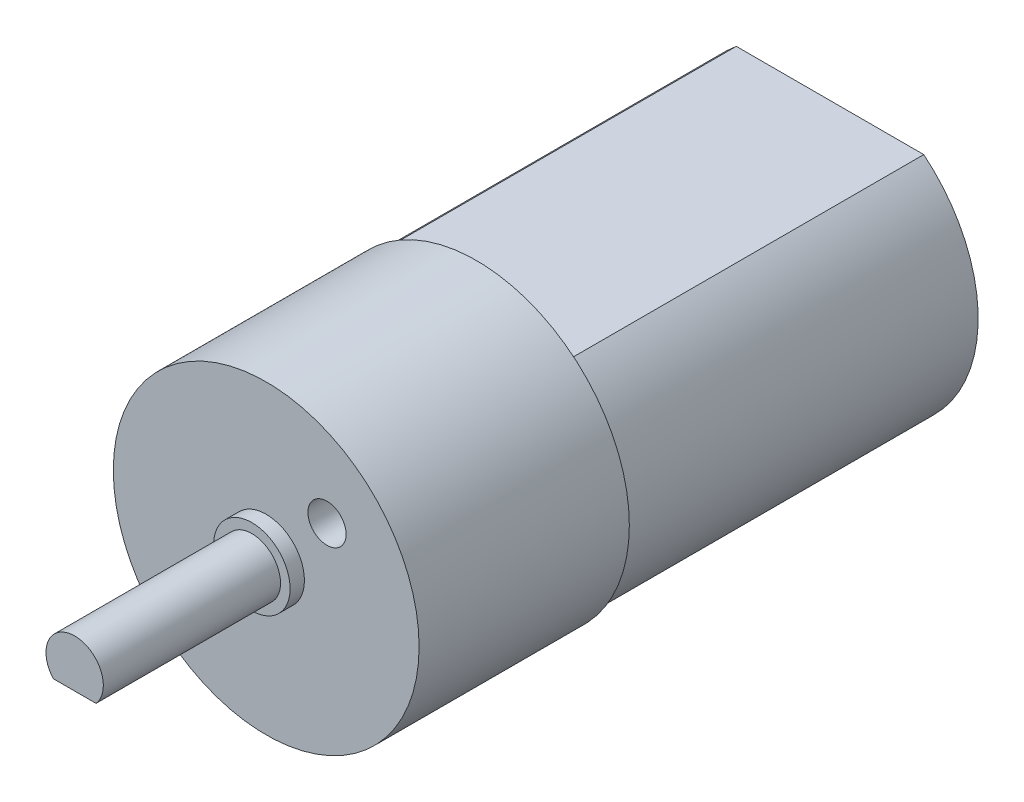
ISO-10303-21;
HEADER;
FILE_DESCRIPTION(('STEP AP214'),'2;1');
FILE_NAME('part.step','',(''),(''),'','','');
FILE_SCHEMA(('AUTOMOTIVE_DESIGN { 1 0 10303 214 1 1 1 1 }'));
ENDSEC;
DATA;
#1=APPLICATION_CONTEXT('core data for automotive mechanical design processes');
#2=APPLICATION_PROTOCOL_DEFINITION('international standard','automotive_design',2000,#1);
#3=PRODUCT_CONTEXT('',#1,'mechanical');
#4=PRODUCT('Part','Part','',(#3));
#5=PRODUCT_RELATED_PRODUCT_CATEGORY('part','',(#4));
#6=PRODUCT_DEFINITION_FORMATION('','',#4);
#7=PRODUCT_DEFINITION_CONTEXT('part definition',#1,'design');
#8=PRODUCT_DEFINITION('design','',#6,#7);
#9=PRODUCT_DEFINITION_SHAPE('','',#8);
#10=(LENGTH_UNIT() NAMED_UNIT(*) SI_UNIT(.MILLI.,.METRE.));
#11=(NAMED_UNIT(*) PLANE_ANGLE_UNIT() SI_UNIT($,.RADIAN.));
#12=(NAMED_UNIT(*) SI_UNIT($,.STERADIAN.) SOLID_ANGLE_UNIT());
#13=UNCERTAINTY_MEASURE_WITH_UNIT(LENGTH_MEASURE(1.E-05),#10,'distance_accuracy_value','');
#14=(GEOMETRIC_REPRESENTATION_CONTEXT(3) GLOBAL_UNCERTAINTY_ASSIGNED_CONTEXT((#13)) GLOBAL_UNIT_ASSIGNED_CONTEXT((#10,
#11,#12)) REPRESENTATION_CONTEXT('',''));
#15=CARTESIAN_POINT('',(0.,0.,0.));
#16=DIRECTION('',(0.,0.,1.));
#17=DIRECTION('',(1.,0.,0.));
#18=AXIS2_PLACEMENT_3D('',#15,#16,#17);
#19=CARTESIAN_POINT('',(0.,0.,11.75));
#20=DIRECTION('',(0.,0.,1.));
#21=DIRECTION('',(1.,0.,0.));
#22=AXIS2_PLACEMENT_3D('',#19,#20,#21);
#23=PLANE('',#22);
#24=CARTESIAN_POINT('',(0.,0.,11.75));
#25=DIRECTION('',(0.,0.,1.));
#26=DIRECTION('',(1.,0.,0.));
#27=AXIS2_PLACEMENT_3D('',#24,#25,#26);
#28=CIRCLE('',#27,1.5);
#29=CARTESIAN_POINT('',(1.1180339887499,-1.,11.75));
#30=VERTEX_POINT('',#29);
#31=CARTESIAN_POINT('',(-1.1180339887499,-1.,11.75));
#32=VERTEX_POINT('',#31);
#33=EDGE_CURVE('E102',#30,#32,#28,.T.);
#34=ORIENTED_EDGE('',*,*,#33,.F.);
#35=DIRECTION('',(-1.,0.,0.));
#36=VECTOR('',#35,1.);
#37=CARTESIAN_POINT('',(-1.1180339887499,-1.,11.75));
#38=LINE('',#37,#36);
#39=EDGE_CURVE('E101',#30,#32,#38,.T.);
#40=ORIENTED_EDGE('',*,*,#39,.T.);
#41=EDGE_LOOP('',(#34,#40));
#42=FACE_BOUND('',#41,.T.);
#43=CARTESIAN_POINT('',(0.,0.,11.75));
#44=DIRECTION('',(0.,0.,1.));
#45=DIRECTION('',(1.,0.,0.));
#46=AXIS2_PLACEMENT_3D('',#43,#44,#45);
#47=CIRCLE('',#46,2.);
#48=CARTESIAN_POINT('',(2.,0.,11.75));
#49=VERTEX_POINT('',#48);
#50=EDGE_CURVE('E110',#49,#49,#47,.T.);
#51=ORIENTED_EDGE('',*,*,#50,.T.);
#52=EDGE_LOOP('',(#51));
#53=FACE_BOUND('',#52,.T.);
#54=ADVANCED_FACE('F37',(#42,#53),#23,.T.);
#55=CARTESIAN_POINT('',(0.,0.,11.));
#56=DIRECTION('',(0.,0.,1.));
#57=DIRECTION('',(1.,0.,0.));
#58=AXIS2_PLACEMENT_3D('',#55,#56,#57);
#59=PLANE('',#58);
#60=CARTESIAN_POINT('',(3.18198051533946,3.18198051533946,11.));
#61=DIRECTION('',(0.,0.,1.));
#62=DIRECTION('',(1.,0.,0.));
#63=AXIS2_PLACEMENT_3D('',#60,#61,#62);
#64=CIRCLE('',#63,1.);
#65=CARTESIAN_POINT('',(4.18198051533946,3.18198051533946,11.));
#66=VERTEX_POINT('',#65);
#67=EDGE_CURVE('E97',#66,#66,#64,.T.);
#68=ORIENTED_EDGE('',*,*,#67,.F.);
#69=EDGE_LOOP('',(#68));
#70=FACE_BOUND('',#69,.T.);
#71=CARTESIAN_POINT('',(-3.18198051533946,-3.18198051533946,11.));
#72=DIRECTION('',(0.,0.,1.));
#73=DIRECTION('',(1.,0.,0.));
#74=AXIS2_PLACEMENT_3D('',#71,#72,#73);
#75=CIRCLE('',#74,1.);
#76=CARTESIAN_POINT('',(-2.18198051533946,-3.18198051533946,11.));
#77=VERTEX_POINT('',#76);
#78=EDGE_CURVE('E269',#77,#77,#75,.T.);
#79=ORIENTED_EDGE('',*,*,#78,.F.);
#80=EDGE_LOOP('',(#79));
#81=FACE_BOUND('',#80,.T.);
#82=CARTESIAN_POINT('',(0.,0.,11.));
#83=DIRECTION('',(0.,0.,1.));
#84=DIRECTION('',(1.,0.,0.));
#85=AXIS2_PLACEMENT_3D('',#82,#83,#84);
#86=CIRCLE('',#85,8.);
#87=CARTESIAN_POINT('',(8.,0.,11.));
#88=VERTEX_POINT('',#87);
#89=EDGE_CURVE('E140',#88,#88,#86,.T.);
#90=ORIENTED_EDGE('',*,*,#89,.T.);
#91=EDGE_LOOP('',(#90));
#92=FACE_BOUND('',#91,.T.);
#93=CARTESIAN_POINT('',(0.,0.,11.));
#94=DIRECTION('',(0.,0.,1.));
#95=DIRECTION('',(1.,0.,0.));
#96=AXIS2_PLACEMENT_3D('',#93,#94,#95);
#97=CIRCLE('',#96,2.);
#98=CARTESIAN_POINT('',(2.,0.,11.));
#99=VERTEX_POINT('',#98);
#100=EDGE_CURVE('E104',#99,#99,#97,.T.);
#101=ORIENTED_EDGE('',*,*,#100,.F.);
#102=EDGE_LOOP('',(#101));
#103=FACE_BOUND('',#102,.T.);
#104=ADVANCED_FACE('F174',(#70,#81,#92,#103),#59,.T.);
#105=CARTESIAN_POINT('',(0.,0.,-18.5));
#106=DIRECTION('',(0.,0.,1.));
#107=DIRECTION('',(1.,0.,0.));
#108=AXIS2_PLACEMENT_3D('',#105,#106,#107);
#109=CYLINDRICAL_SURFACE('',#108,7.75);
#110=CARTESIAN_POINT('',(0.,0.,0.));
#111=DIRECTION('',(0.,0.,1.));
#112=DIRECTION('',(1.,0.,0.));
#113=AXIS2_PLACEMENT_3D('',#110,#111,#112);
#114=CIRCLE('',#113,7.75);
#115=CARTESIAN_POINT('',(4.90535421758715,6.,0.));
#116=VERTEX_POINT('',#115);
#117=CARTESIAN_POINT('',(4.90535421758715,-6.,0.));
#118=VERTEX_POINT('',#117);
#119=EDGE_CURVE('E45',#116,#118,#114,.F.);
#120=ORIENTED_EDGE('',*,*,#119,.T.);
#121=DIRECTION('',(0.,0.,-1.));
#122=VECTOR('',#121,1.);
#123=CARTESIAN_POINT('',(4.90535421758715,-6.,0.));
#124=LINE('',#123,#122);
#125=CARTESIAN_POINT('',(4.90535421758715,-6.,-18.5));
#126=VERTEX_POINT('',#125);
#127=EDGE_CURVE('E120',#118,#126,#124,.T.);
#128=ORIENTED_EDGE('',*,*,#127,.T.);
#129=CARTESIAN_POINT('',(0.,0.,-18.5));
#130=DIRECTION('',(0.,0.,-1.));
#131=DIRECTION('',(-1.,0.,0.));
#132=AXIS2_PLACEMENT_3D('',#129,#130,#131);
#133=CIRCLE('',#132,7.75);
#134=CARTESIAN_POINT('',(4.90535421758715,6.,-18.5));
#135=VERTEX_POINT('',#134);
#136=EDGE_CURVE('E136',#135,#126,#133,.T.);
#137=ORIENTED_EDGE('',*,*,#136,.F.);
#138=DIRECTION('',(0.,0.,-1.));
#139=VECTOR('',#138,1.);
#140=CARTESIAN_POINT('',(4.90535421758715,6.,0.));
#141=LINE('',#140,#139);
#142=EDGE_CURVE('E128',#116,#135,#141,.T.);
#143=ORIENTED_EDGE('',*,*,#142,.F.);
#144=EDGE_LOOP('',(#120,#128,#137,#143));
#145=FACE_BOUND('',#144,.T.);
#146=ADVANCED_FACE('F162',(#145),#109,.T.);
#147=CARTESIAN_POINT('',(0.,0.,0.));
#148=DIRECTION('',(0.,0.,1.));
#149=DIRECTION('',(1.,0.,0.));
#150=AXIS2_PLACEMENT_3D('',#147,#148,#149);
#151=PLANE('',#150);
#152=DIRECTION('',(1.,0.,0.));
#153=VECTOR('',#152,1.);
#154=CARTESIAN_POINT('',(4.90535421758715,-6.,0.));
#155=LINE('',#154,#153);
#156=CARTESIAN_POINT('',(-4.90535421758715,-6.,0.));
#157=VERTEX_POINT('',#156);
#158=EDGE_CURVE('E116',#157,#118,#155,.T.);
#159=ORIENTED_EDGE('',*,*,#158,.T.);
#160=ORIENTED_EDGE('',*,*,#119,.F.);
#161=DIRECTION('',(-1.,0.,0.));
#162=VECTOR('',#161,1.);
#163=CARTESIAN_POINT('',(4.90535421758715,6.,0.));
#164=LINE('',#163,#162);
#165=CARTESIAN_POINT('',(-4.90535421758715,6.,0.));
#166=VERTEX_POINT('',#165);
#167=EDGE_CURVE('E125',#116,#166,#164,.T.);
#168=ORIENTED_EDGE('',*,*,#167,.T.);
#169=EDGE_CURVE('E143',#157,#166,#114,.F.);
#170=ORIENTED_EDGE('',*,*,#169,.F.);
#171=EDGE_LOOP('',(#159,#160,#168,#170));
#172=FACE_BOUND('',#171,.T.);
#173=CARTESIAN_POINT('',(0.,0.,0.));
#174=DIRECTION('',(0.,0.,1.));
#175=DIRECTION('',(1.,0.,0.));
#176=AXIS2_PLACEMENT_3D('',#173,#174,#175);
#177=CIRCLE('',#176,8.);
#178=CARTESIAN_POINT('',(8.,0.,0.));
#179=VERTEX_POINT('',#178);
#180=EDGE_CURVE('E139',#179,#179,#177,.T.);
#181=ORIENTED_EDGE('',*,*,#180,.F.);
#182=EDGE_LOOP('',(#181));
#183=FACE_BOUND('',#182,.T.);
#184=ADVANCED_FACE('F158',(#172,#183),#151,.F.);
#185=CARTESIAN_POINT('',(0.,0.,11.));
#186=DIRECTION('',(0.,0.,-1.));
#187=DIRECTION('',(-1.,0.,0.));
#188=AXIS2_PLACEMENT_3D('',#185,#186,#187);
#189=CYLINDRICAL_SURFACE('',#188,8.);
#190=ORIENTED_EDGE('',*,*,#89,.F.);
#191=EDGE_LOOP('',(#190));
#192=FACE_BOUND('',#191,.T.);
#193=ORIENTED_EDGE('',*,*,#180,.T.);
#194=EDGE_LOOP('',(#193));
#195=FACE_BOUND('',#194,.T.);
#196=ADVANCED_FACE('F39',(#192,#195),#189,.T.);
#197=CARTESIAN_POINT('',(-4.90535421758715,-6.,-18.5));
#198=VERTEX_POINT('',#197);
#199=CARTESIAN_POINT('',(-4.90535421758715,6.,-18.5));
#200=VERTEX_POINT('',#199);
#201=EDGE_CURVE('E134',#198,#200,#133,.T.);
#202=ORIENTED_EDGE('',*,*,#201,.F.);
#203=DIRECTION('',(0.,0.,-1.));
#204=VECTOR('',#203,1.);
#205=CARTESIAN_POINT('',(-4.90535421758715,-6.,0.));
#206=LINE('',#205,#204);
#207=EDGE_CURVE('E58',#157,#198,#206,.T.);
#208=ORIENTED_EDGE('',*,*,#207,.F.);
#209=ORIENTED_EDGE('',*,*,#169,.T.);
#210=DIRECTION('',(0.,0.,-1.));
#211=VECTOR('',#210,1.);
#212=CARTESIAN_POINT('',(-4.90535421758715,6.,0.));
#213=LINE('',#212,#211);
#214=EDGE_CURVE('E131',#166,#200,#213,.T.);
#215=ORIENTED_EDGE('',*,*,#214,.T.);
#216=EDGE_LOOP('',(#202,#208,#209,#215));
#217=FACE_BOUND('',#216,.T.);
#218=ADVANCED_FACE('F153',(#217),#109,.T.);
#219=CARTESIAN_POINT('',(0.,0.,-18.5));
#220=DIRECTION('',(0.,0.,-1.));
#221=DIRECTION('',(-1.,0.,0.));
#222=AXIS2_PLACEMENT_3D('',#219,#220,#221);
#223=PLANE('',#222);
#224=DIRECTION('',(1.,0.,0.));
#225=VECTOR('',#224,1.);
#226=CARTESIAN_POINT('',(4.90535421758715,-6.,-18.5));
#227=LINE('',#226,#225);
#228=EDGE_CURVE('E113',#198,#126,#227,.T.);
#229=ORIENTED_EDGE('',*,*,#228,.F.);
#230=ORIENTED_EDGE('',*,*,#201,.T.);
#231=DIRECTION('',(-1.,0.,0.));
#232=VECTOR('',#231,1.);
#233=CARTESIAN_POINT('',(4.90535421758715,6.,-18.5));
#234=LINE('',#233,#232);
#235=EDGE_CURVE('E123',#135,#200,#234,.T.);
#236=ORIENTED_EDGE('',*,*,#235,.F.);
#237=ORIENTED_EDGE('',*,*,#136,.T.);
#238=EDGE_LOOP('',(#229,#230,#236,#237));
#239=FACE_BOUND('',#238,.T.);
#240=ADVANCED_FACE('F164',(#239),#223,.T.);
#241=CARTESIAN_POINT('',(4.90535421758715,6.,0.));
#242=DIRECTION('',(0.,-1.,0.));
#243=DIRECTION('',(0.,0.,-1.));
#244=AXIS2_PLACEMENT_3D('',#241,#242,#243);
#245=PLANE('',#244);
#246=ORIENTED_EDGE('',*,*,#235,.T.);
#247=ORIENTED_EDGE('',*,*,#214,.F.);
#248=ORIENTED_EDGE('',*,*,#167,.F.);
#249=ORIENTED_EDGE('',*,*,#142,.T.);
#250=EDGE_LOOP('',(#246,#247,#248,#249));
#251=FACE_BOUND('',#250,.T.);
#252=ADVANCED_FACE('F156',(#251),#245,.F.);
#253=CARTESIAN_POINT('',(4.90535421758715,-6.,0.));
#254=DIRECTION('',(0.,1.,0.));
#255=DIRECTION('',(0.,0.,1.));
#256=AXIS2_PLACEMENT_3D('',#253,#254,#255);
#257=PLANE('',#256);
#258=ORIENTED_EDGE('',*,*,#228,.T.);
#259=ORIENTED_EDGE('',*,*,#127,.F.);
#260=ORIENTED_EDGE('',*,*,#158,.F.);
#261=ORIENTED_EDGE('',*,*,#207,.T.);
#262=EDGE_LOOP('',(#258,#259,#260,#261));
#263=FACE_BOUND('',#262,.T.);
#264=ADVANCED_FACE('F160',(#263),#257,.F.);
#265=CARTESIAN_POINT('',(0.,0.,11.75));
#266=DIRECTION('',(0.,0.,-1.));
#267=DIRECTION('',(-1.,0.,0.));
#268=AXIS2_PLACEMENT_3D('',#265,#266,#267);
#269=CYLINDRICAL_SURFACE('',#268,2.);
#270=ORIENTED_EDGE('',*,*,#50,.F.);
#271=EDGE_LOOP('',(#270));
#272=FACE_BOUND('',#271,.T.);
#273=ORIENTED_EDGE('',*,*,#100,.T.);
#274=EDGE_LOOP('',(#273));
#275=FACE_BOUND('',#274,.T.);
#276=ADVANCED_FACE('F186',(#272,#275),#269,.T.);
#277=CARTESIAN_POINT('',(0.,0.,26.75));
#278=DIRECTION('',(0.,0.,-1.));
#279=DIRECTION('',(-1.,0.,0.));
#280=AXIS2_PLACEMENT_3D('',#277,#278,#279);
#281=CYLINDRICAL_SURFACE('',#280,1.5);
#282=DIRECTION('',(0.,0.,1.));
#283=VECTOR('',#282,1.);
#284=CARTESIAN_POINT('',(-1.1180339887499,-1.,11.75));
#285=LINE('',#284,#283);
#286=CARTESIAN_POINT('',(-1.1180339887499,-1.,21.021));
#287=VERTEX_POINT('',#286);
#288=EDGE_CURVE('E96',#32,#287,#285,.T.);
#289=ORIENTED_EDGE('',*,*,#288,.T.);
#290=CARTESIAN_POINT('',(0.,0.,21.021));
#291=DIRECTION('',(0.,0.,-1.));
#292=DIRECTION('',(-1.,0.,0.));
#293=AXIS2_PLACEMENT_3D('',#290,#291,#292);
#294=CIRCLE('',#293,1.5);
#295=CARTESIAN_POINT('',(1.1180339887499,-1.,21.021));
#296=VERTEX_POINT('',#295);
#297=EDGE_CURVE('E51',#287,#296,#294,.T.);
#298=ORIENTED_EDGE('',*,*,#297,.T.);
#299=DIRECTION('',(0.,0.,1.));
#300=VECTOR('',#299,1.);
#301=CARTESIAN_POINT('',(1.1180339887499,-1.,11.75));
#302=LINE('',#301,#300);
#303=EDGE_CURVE('E94',#30,#296,#302,.T.);
#304=ORIENTED_EDGE('',*,*,#303,.F.);
#305=ORIENTED_EDGE('',*,*,#33,.T.);
#306=EDGE_LOOP('',(#289,#298,#304,#305));
#307=FACE_BOUND('',#306,.T.);
#308=ADVANCED_FACE('F92',(#307),#281,.T.);
#309=CARTESIAN_POINT('',(-1.1180339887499,-1.,11.75));
#310=DIRECTION('',(0.,1.,0.));
#311=DIRECTION('',(0.,0.,1.));
#312=AXIS2_PLACEMENT_3D('',#309,#310,#311);
#313=PLANE('',#312);
#314=ORIENTED_EDGE('',*,*,#303,.T.);
#315=DIRECTION('',(-1.,0.,0.));
#316=VECTOR('',#315,1.);
#317=CARTESIAN_POINT('',(-1.1180339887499,-1.,21.021));
#318=LINE('',#317,#316);
#319=EDGE_CURVE('E11',#296,#287,#318,.T.);
#320=ORIENTED_EDGE('',*,*,#319,.T.);
#321=ORIENTED_EDGE('',*,*,#288,.F.);
#322=ORIENTED_EDGE('',*,*,#39,.F.);
#323=EDGE_LOOP('',(#314,#320,#321,#322));
#324=FACE_BOUND('',#323,.T.);
#325=ADVANCED_FACE('F99',(#324),#313,.F.);
#326=CARTESIAN_POINT('',(-3.18198051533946,-3.18198051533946,6.));
#327=DIRECTION('',(0.,0.,1.));
#328=DIRECTION('',(1.,0.,0.));
#329=AXIS2_PLACEMENT_3D('',#326,#327,#328);
#330=CYLINDRICAL_SURFACE('',#329,1.);
#331=CARTESIAN_POINT('',(-3.18198051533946,-3.18198051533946,6.));
#332=DIRECTION('',(0.,0.,1.));
#333=DIRECTION('',(1.,0.,0.));
#334=AXIS2_PLACEMENT_3D('',#331,#332,#333);
#335=CIRCLE('',#334,1.);
#336=CARTESIAN_POINT('',(-2.18198051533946,-3.18198051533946,6.));
#337=VERTEX_POINT('',#336);
#338=EDGE_CURVE('E272',#337,#337,#335,.T.);
#339=ORIENTED_EDGE('',*,*,#338,.F.);
#340=EDGE_LOOP('',(#339));
#341=FACE_BOUND('',#340,.T.);
#342=ORIENTED_EDGE('',*,*,#78,.T.);
#343=EDGE_LOOP('',(#342));
#344=FACE_BOUND('',#343,.T.);
#345=ADVANCED_FACE('F216',(#341,#344),#330,.F.);
#346=CARTESIAN_POINT('',(-3.18198051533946,-3.18198051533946,6.));
#347=DIRECTION('',(0.,0.,1.));
#348=DIRECTION('',(1.,0.,0.));
#349=AXIS2_PLACEMENT_3D('',#346,#347,#348);
#350=PLANE('',#349);
#351=ORIENTED_EDGE('',*,*,#338,.T.);
#352=EDGE_LOOP('',(#351));
#353=FACE_BOUND('',#352,.T.);
#354=ADVANCED_FACE('F225',(#353),#350,.T.);
#355=CARTESIAN_POINT('',(3.18198051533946,3.18198051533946,6.));
#356=DIRECTION('',(0.,0.,1.));
#357=DIRECTION('',(1.,0.,0.));
#358=AXIS2_PLACEMENT_3D('',#355,#356,#357);
#359=CYLINDRICAL_SURFACE('',#358,1.);
#360=CARTESIAN_POINT('',(3.18198051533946,3.18198051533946,6.));
#361=DIRECTION('',(0.,0.,1.));
#362=DIRECTION('',(1.,0.,0.));
#363=AXIS2_PLACEMENT_3D('',#360,#361,#362);
#364=CIRCLE('',#363,1.);
#365=CARTESIAN_POINT('',(4.18198051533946,3.18198051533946,6.));
#366=VERTEX_POINT('',#365);
#367=EDGE_CURVE('E268',#366,#366,#364,.T.);
#368=ORIENTED_EDGE('',*,*,#367,.F.);
#369=EDGE_LOOP('',(#368));
#370=FACE_BOUND('',#369,.T.);
#371=ORIENTED_EDGE('',*,*,#67,.T.);
#372=EDGE_LOOP('',(#371));
#373=FACE_BOUND('',#372,.T.);
#374=ADVANCED_FACE('F233',(#370,#373),#359,.F.);
#375=CARTESIAN_POINT('',(3.18198051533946,3.18198051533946,6.));
#376=DIRECTION('',(0.,0.,1.));
#377=DIRECTION('',(1.,0.,0.));
#378=AXIS2_PLACEMENT_3D('',#375,#376,#377);
#379=PLANE('',#378);
#380=ORIENTED_EDGE('',*,*,#367,.T.);
#381=EDGE_LOOP('',(#380));
#382=FACE_BOUND('',#381,.T.);
#383=ADVANCED_FACE('F241',(#382),#379,.T.);
#384=CARTESIAN_POINT('',(10.5453205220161,9.,21.021));
#385=DIRECTION('',(0.,0.,-1.));
#386=DIRECTION('',(-1.,0.,0.));
#387=AXIS2_PLACEMENT_3D('',#384,#385,#386);
#388=PLANE('',#387);
#389=ORIENTED_EDGE('',*,*,#319,.F.);
#390=ORIENTED_EDGE('',*,*,#297,.F.);
#391=EDGE_LOOP('',(#389,#390));
#392=FACE_BOUND('',#391,.T.);
#393=ADVANCED_FACE('F86',(#392),#388,.F.);
#394=CLOSED_SHELL('',(#54,#104,#146,#184,#196,#218,#240,#252,#264,#276,#308,#325,#345,#354,#374,
#383,#393));
#395=MANIFOLD_SOLID_BREP('B2',#394);
#396=ADVANCED_BREP_SHAPE_REPRESENTATION('',(#18,#395),#14);
#397=SHAPE_DEFINITION_REPRESENTATION(#9,#396);
ENDSEC;
END-ISO-10303-21;
